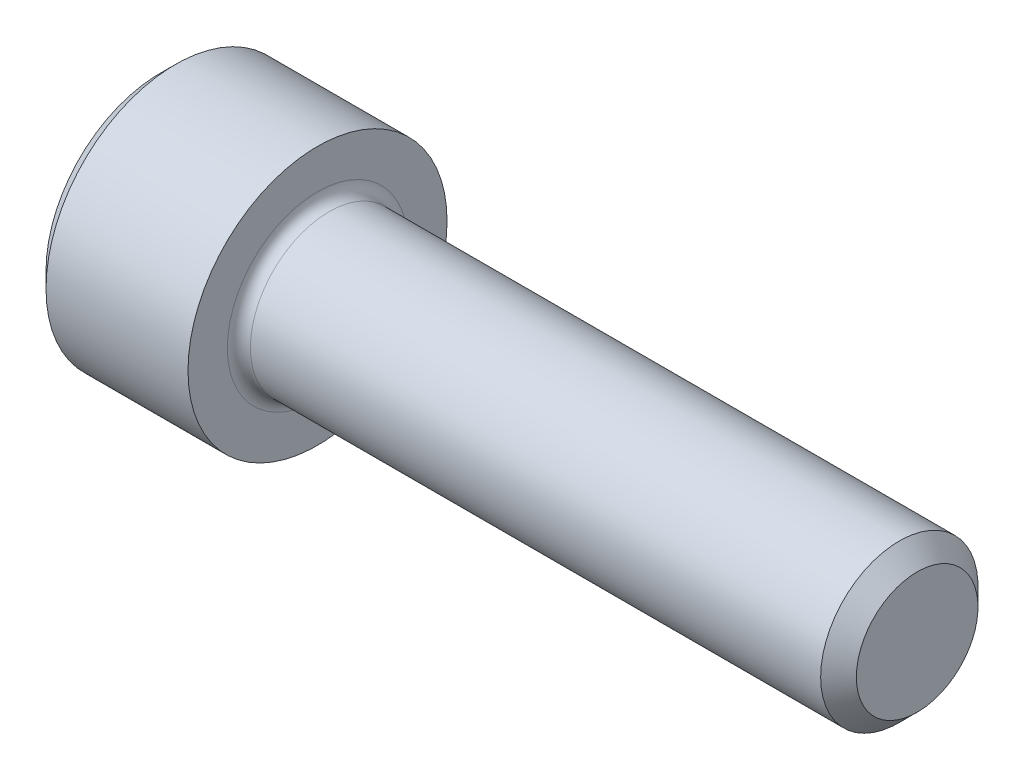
from build123d import *

# Parameters (mm, degrees)
FILLET1_R   = 0.3048
HEX_2_DEPTH = 1.9558


with BuildPart() as part:
    # BodySke → Base-Revolve (revolve)
    with BuildSketch(Plane.XY, mode=Mode.PRIVATE) as base_revolve_sk:
        Polygon((0, 0), (0, 3.0226), (0.4064, 3.429), (4.1656, 3.429), (4.1656, 2.0828), (19.56816, 2.0828), (20.0406, 1.61036), (20.0406, 0), align=None)
    revolve(base_revolve_sk.sketch.rotate(Axis((-31.75, 0, 0), (1, 0, 0)), 90), axis=Axis((-31.75, 0, 0), (1, 0, 0)))

    # Fillet1
    fillet1_edges = [part.edges().sort_by_distance(p)[0] for p in [
        (4.1656, 0, -2.0828),
    ]]
    fillet(fillet1_edges, radius=FILLET1_R)

    # Sketch2 → Hex-PreBroach (revolve, cut)
    with BuildSketch(Plane.XY, mode=Mode.PRIVATE) as hex_prebroach_sk:
        Polygon((0, 1.778), (1.9558, 1.778), (2.982328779, 0), (0, 0), align=None)
    revolve(hex_prebroach_sk.sketch.rotate(Axis((0, 0, 0), (1, 0, 0)), 90), axis=Axis((0, 0, 0), (1, 0, 0)), mode=Mode.SUBTRACT)

    # Sketch3 → Hex 2 (cut)
    with BuildSketch(Plane(origin=(0, 0, 0), x_dir=(0, 0.500000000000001, 0.866025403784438), z_dir=(-1, 0, 0))):
        Polygon((1.026528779, 1.778), (-1.026528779, 1.778), (-2.053057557, 0), (-1.026528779, -1.778), (1.026528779, -1.778), (2.053057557, 0), align=None)
    extrude(amount=-HEX_2_DEPTH, mode=Mode.SUBTRACT)


solid = part.part
